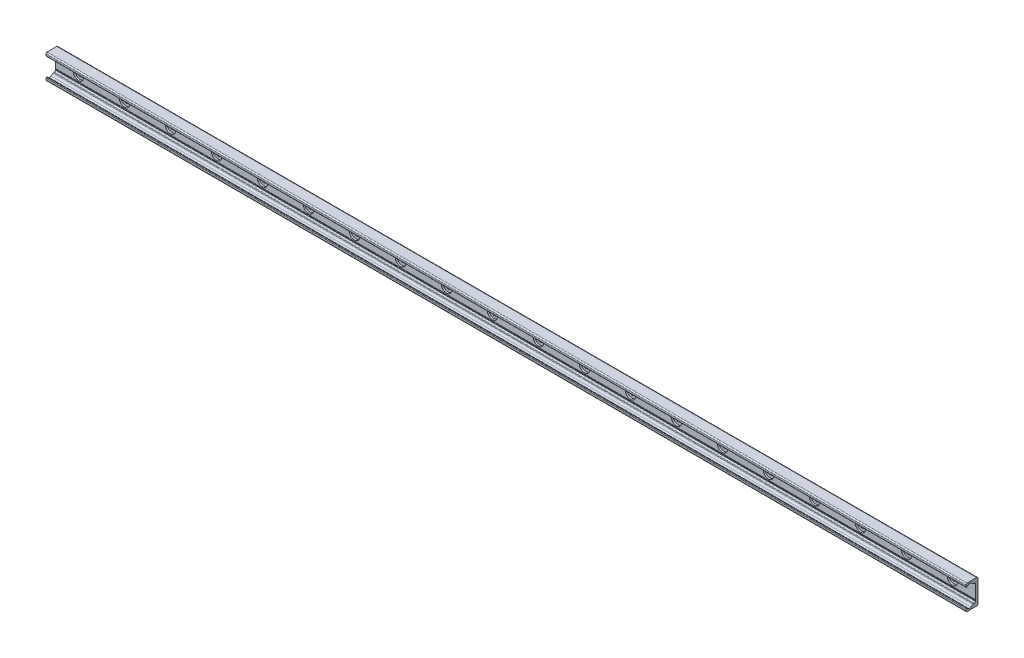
from build123d import *

# Parameters (mm, degrees)
BOSS_EXTRUDE1_DEPTH = 800
SKETCH2_R           = 9
SKETCH2_R_2         = 4.5
CUT_EXTRUDE1_DEPTH  = 3.1
SKETCH2_2_R         = 4.5
CUT_EXTRUDE2_DEPTH  = 801.458930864
LPATTERN1_COUNT     = 20
LPATTERN1_PITCH     = 80


with BuildPart() as part:
    # Sketch1 → Boss-Extrude1 (new, symmetric)
    with BuildSketch(Plane(origin=(0, 0, 0), x_dir=(0, 0, -1), z_dir=(1, 0, 0))):
        with BuildLine():
            Line((0, 0), (0, 19))
            ThreePointArc((0, 19), (-0.732233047, 20.767766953), (-2.5, 21.5))
            Line((-2.5, 21.5), (-19, 21.5))
            ThreePointArc((-19, 21.5), (-20.414213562, 20.914213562), (-21, 19.5))
            Line((-21, 19.5), (-21, 16.625057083))
            ThreePointArc((-21, 16.625057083), (-20.553251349, 15.888838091), (-19.693931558, 15.945160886))
            Line((-19.693931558, 15.945160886), (-16.794305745, 17.975500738))
            ThreePointArc((-16.794305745, 17.975500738), (-14.5, 18.69889256), (-12.205694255, 17.975500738))
            Line((-12.205694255, 17.975500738), (-8.829831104, 15.611695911))
            ThreePointArc((-8.829831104, 15.611695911), (-8.28408983, 15.342566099), (-7.682678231, 15.25))
            Line((-7.682678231, 15.25), (-6.5, 15.25))
            ThreePointArc((-6.5, 15.25), (-5.085786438, 14.664213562), (-4.5, 13.25))
            Line((-4.5, 13.25), (-4.5, -10.75))
            ThreePointArc((-4.5, -10.75), (-4.25, -11), (-4.5, -11.25))
            Line((-4.5, -11.25), (-4.5, -12.25))
            ThreePointArc((-4.5, -12.25), (-4.25, -12.5), (-4.5, -12.75))
            Line((-4.5, -12.75), (-4.5, -13.25))
            ThreePointArc((-4.5, -13.25), (-5.085786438, -14.664213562), (-6.5, -15.25))
            Line((-6.5, -15.25), (-7.682678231, -15.25))
            ThreePointArc((-7.682678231, -15.25), (-8.28408983, -15.342566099), (-8.829831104, -15.611695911))
            Line((-8.829831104, -15.611695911), (-12.205694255, -17.975500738))
            ThreePointArc((-12.205694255, -17.975500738), (-14.5, -18.69889256), (-16.794305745, -17.975500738))
            Line((-16.794305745, -17.975500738), (-19.693931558, -15.945160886))
            ThreePointArc((-19.693931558, -15.945160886), (-20.553251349, -15.888838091), (-21, -16.625057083))
            Line((-21, -16.625057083), (-21, -19.5))
            ThreePointArc((-21, -19.5), (-20.414213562, -20.914213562), (-19, -21.5))
            Line((-19, -21.5), (-2.5, -21.5))
            ThreePointArc((-2.5, -21.5), (-0.732233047, -20.767766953), (0, -19))
            Line((0, -19), (0, 0))
        make_face()
    extrude(amount=BOSS_EXTRUDE1_DEPTH, both=True)

    # Sketch2 → Cut-Extrude1 (cut)
    with BuildSketch(Plane.XY.offset(4.5)):
        with Locations((760, 0)):
            Circle(SKETCH2_R)
        with Locations((760, 0)):
            Circle(SKETCH2_R_2, mode=Mode.SUBTRACT)
    cut_extrude1 = extrude(amount=-CUT_EXTRUDE1_DEPTH, mode=Mode.SUBTRACT)

    # Sketch2_2 → Cut-Extrude2 (cut, through all)
    with BuildSketch(Plane.XY.offset(4.5)):
        with Locations((760, 0)):
            Circle(SKETCH2_2_R)
    cut_extrude2 = extrude(amount=-CUT_EXTRUDE2_DEPTH, mode=Mode.SUBTRACT)

    # LPattern1: Cut-Extrude1, Cut-Extrude2 ×20
    with Locations(*[(-i * LPATTERN1_PITCH, 0, 0) for i in range(1, LPATTERN1_COUNT)]):
        add(cut_extrude1, mode=Mode.SUBTRACT)
        add(cut_extrude2, mode=Mode.SUBTRACT)


solid = part.part
